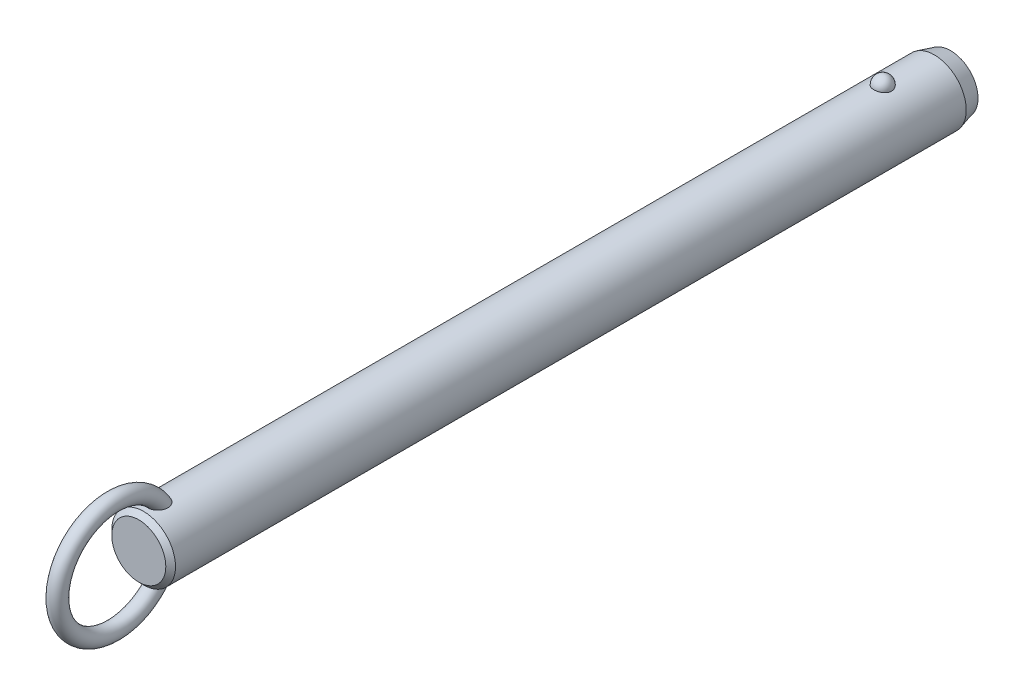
ISO-10303-21;
HEADER;
FILE_DESCRIPTION(('STEP AP214'),'2;1');
FILE_NAME('part.step','',(''),(''),'','','');
FILE_SCHEMA(('AUTOMOTIVE_DESIGN { 1 0 10303 214 1 1 1 1 }'));
ENDSEC;
DATA;
#1=APPLICATION_CONTEXT('core data for automotive mechanical design processes');
#2=APPLICATION_PROTOCOL_DEFINITION('international standard','automotive_design',2000,#1);
#3=PRODUCT_CONTEXT('',#1,'mechanical');
#4=PRODUCT('Part','Part','',(#3));
#5=PRODUCT_RELATED_PRODUCT_CATEGORY('part','',(#4));
#6=PRODUCT_DEFINITION_FORMATION('','',#4);
#7=PRODUCT_DEFINITION_CONTEXT('part definition',#1,'design');
#8=PRODUCT_DEFINITION('design','',#6,#7);
#9=PRODUCT_DEFINITION_SHAPE('','',#8);
#10=(LENGTH_UNIT() NAMED_UNIT(*) SI_UNIT(.MILLI.,.METRE.));
#11=(NAMED_UNIT(*) PLANE_ANGLE_UNIT() SI_UNIT($,.RADIAN.));
#12=(NAMED_UNIT(*) SI_UNIT($,.STERADIAN.) SOLID_ANGLE_UNIT());
#13=UNCERTAINTY_MEASURE_WITH_UNIT(LENGTH_MEASURE(1.E-05),#10,'distance_accuracy_value','');
#14=(GEOMETRIC_REPRESENTATION_CONTEXT(3) GLOBAL_UNCERTAINTY_ASSIGNED_CONTEXT((#13)) GLOBAL_UNIT_ASSIGNED_CONTEXT((#10,
#11,#12)) REPRESENTATION_CONTEXT('',''));
#15=CARTESIAN_POINT('',(0.,0.,0.));
#16=DIRECTION('',(0.,0.,1.));
#17=DIRECTION('',(1.,0.,0.));
#18=AXIS2_PLACEMENT_3D('',#15,#16,#17);
#19=CARTESIAN_POINT('',(0.,0.,172.7));
#20=DIRECTION('',(0.,0.,-1.));
#21=DIRECTION('',(-1.,0.,0.));
#22=AXIS2_PLACEMENT_3D('',#19,#20,#21);
#23=CYLINDRICAL_SURFACE('',#22,7.9);
#24=CARTESIAN_POINT('',(2.1785689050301,7.59367088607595,-2.20000000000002));
#25=CARTESIAN_POINT('',(2.17856679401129,7.59367269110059,-2.07701843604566));
#26=CARTESIAN_POINT('',(2.16853481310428,7.59657145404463,-1.95401006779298));
#27=CARTESIAN_POINT('',(2.12864689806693,7.607843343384,-1.71147811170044));
#28=CARTESIAN_POINT('',(2.09878338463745,7.61621856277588,-1.5919558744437));
#29=CARTESIAN_POINT('',(2.0199931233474,7.63749180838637,-1.35985638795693));
#30=CARTESIAN_POINT('',(1.97107475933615,7.6503878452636,-1.24727610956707));
#31=CARTESIAN_POINT('',(1.85539377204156,7.67926115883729,-1.03213234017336));
#32=CARTESIAN_POINT('',(1.78863158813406,7.69523835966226,-0.929568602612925));
#33=CARTESIAN_POINT('',(1.63856494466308,7.7285848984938,-0.73678633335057));
#34=CARTESIAN_POINT('',(1.55518140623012,7.7459606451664,-0.646630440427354));
#35=CARTESIAN_POINT('',(1.37422937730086,7.78009978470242,-0.481747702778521));
#36=CARTESIAN_POINT('',(1.27666086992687,7.79686317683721,-0.407020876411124));
#37=CARTESIAN_POINT('',(1.07024728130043,7.82786153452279,-0.275278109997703));
#38=CARTESIAN_POINT('',(0.961434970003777,7.84210353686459,-0.218212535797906));
#39=CARTESIAN_POINT('',(0.735351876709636,7.86652194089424,-0.123146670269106));
#40=CARTESIAN_POINT('',(0.618082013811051,7.87669878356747,-0.0851443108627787));
#41=CARTESIAN_POINT('',(0.380637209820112,7.89170521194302,-0.0298158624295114));
#42=CARTESIAN_POINT('',(0.260550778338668,7.89662650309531,-0.0121347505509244));
#43=CARTESIAN_POINT('',(0.0190117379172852,7.90090003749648,0.00324379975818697));
#44=CARTESIAN_POINT('',(-0.102440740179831,7.90025280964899,0.000943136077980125));
#45=CARTESIAN_POINT('',(-0.341452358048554,7.89351056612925,-0.0233955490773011));
#46=CARTESIAN_POINT('',(-0.459042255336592,7.88749257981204,-0.0451545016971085));
#47=CARTESIAN_POINT('',(-0.688796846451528,7.87075812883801,-0.107408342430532));
#48=CARTESIAN_POINT('',(-0.800961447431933,7.86004158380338,-0.14790355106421));
#49=CARTESIAN_POINT('',(-1.01743634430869,7.83497131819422,-0.246799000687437));
#50=CARTESIAN_POINT('',(-1.12169791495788,7.82059709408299,-0.305300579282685));
#51=CARTESIAN_POINT('',(-1.31891765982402,7.78976470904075,-0.43854939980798));
#52=CARTESIAN_POINT('',(-1.41187469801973,7.77330633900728,-0.513298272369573));
#53=CARTESIAN_POINT('',(-1.58577142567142,7.73972434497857,-0.678622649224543));
#54=CARTESIAN_POINT('',(-1.66645140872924,7.72259402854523,-0.769470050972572));
#55=CARTESIAN_POINT('',(-1.81161503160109,7.68983776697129,-0.963538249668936));
#56=CARTESIAN_POINT('',(-1.87609753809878,7.6742119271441,-1.0667599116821));
#57=CARTESIAN_POINT('',(-1.98790138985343,7.6460202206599,-1.28401170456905));
#58=CARTESIAN_POINT('',(-2.03501994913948,7.63349104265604,-1.39815107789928));
#59=CARTESIAN_POINT('',(-2.10986724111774,7.6131449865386,-1.6330178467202));
#60=CARTESIAN_POINT('',(-2.1375965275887,7.60532797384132,-1.75374505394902));
#61=CARTESIAN_POINT('',(-2.17289256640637,7.5953195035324,-1.99782562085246));
#62=CARTESIAN_POINT('',(-2.18054294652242,7.59310471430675,-2.12116592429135));
#63=CARTESIAN_POINT('',(-2.17572919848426,7.59448538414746,-2.36741799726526));
#64=CARTESIAN_POINT('',(-2.1632656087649,7.59808068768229,-2.49032977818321));
#65=CARTESIAN_POINT('',(-2.11865035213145,7.61064035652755,-2.73161015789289));
#66=CARTESIAN_POINT('',(-2.08659579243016,7.61957823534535,-2.84999812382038));
#67=CARTESIAN_POINT('',(-2.00367799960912,7.64179982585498,-3.07955956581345));
#68=CARTESIAN_POINT('',(-1.9528140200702,7.65508371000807,-3.19073275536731));
#69=CARTESIAN_POINT('',(-1.83321113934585,7.68460381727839,-3.40337899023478));
#70=CARTESIAN_POINT('',(-1.76437735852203,7.70085556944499,-3.5047965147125));
#71=CARTESIAN_POINT('',(-1.61069526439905,7.73445734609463,-3.69446912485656));
#72=CARTESIAN_POINT('',(-1.52584634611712,7.75180741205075,-3.78272371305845));
#73=CARTESIAN_POINT('',(-1.34198059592,7.78574608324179,-3.94393987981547));
#74=CARTESIAN_POINT('',(-1.24291308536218,7.80233167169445,-4.01684434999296));
#75=CARTESIAN_POINT('',(-1.03352039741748,7.83281625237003,-4.14489386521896));
#76=CARTESIAN_POINT('',(-0.92319600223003,7.84671543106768,-4.20004014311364));
#77=CARTESIAN_POINT('',(-0.695822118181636,7.87011575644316,-4.29042017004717));
#78=CARTESIAN_POINT('',(-0.578872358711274,7.87966903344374,-4.32589112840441));
#79=CARTESIAN_POINT('',(-0.340410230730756,7.8935652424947,-4.37692226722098));
#80=CARTESIAN_POINT('',(-0.218898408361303,7.89790879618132,-4.39248482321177));
#81=CARTESIAN_POINT('',(0.0228107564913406,7.90087453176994,-4.40314405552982));
#82=CARTESIAN_POINT('',(0.142990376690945,7.89960185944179,-4.39861683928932));
#83=CARTESIAN_POINT('',(0.380829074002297,7.89171262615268,-4.37008293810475));
#84=CARTESIAN_POINT('',(0.498488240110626,7.8850962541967,-4.34607694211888));
#85=CARTESIAN_POINT('',(0.727535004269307,7.86726442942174,-4.27939317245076));
#86=CARTESIAN_POINT('',(0.838944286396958,7.85606616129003,-4.23678512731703));
#87=CARTESIAN_POINT('',(1.05295421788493,7.83025654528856,-4.13408348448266));
#88=CARTESIAN_POINT('',(1.15555431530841,7.81564498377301,-4.07398879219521));
#89=CARTESIAN_POINT('',(1.35076763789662,7.7843022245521,-3.93687432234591));
#90=CARTESIAN_POINT('',(1.4432046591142,7.76754209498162,-3.85961036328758));
#91=CARTESIAN_POINT('',(1.6139111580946,7.73387857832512,-3.69076949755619));
#92=CARTESIAN_POINT('',(1.6921781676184,7.71697516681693,-3.59919010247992));
#93=CARTESIAN_POINT('',(1.83380875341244,7.6845643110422,-3.40247278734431));
#94=CARTESIAN_POINT('',(1.89689280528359,7.66908588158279,-3.29712873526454));
#95=CARTESIAN_POINT('',(2.0047823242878,7.64159441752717,-3.07707931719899));
#96=CARTESIAN_POINT('',(2.0495945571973,7.62958010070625,-2.96237743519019));
#97=CARTESIAN_POINT('',(2.11580183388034,7.61146617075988,-2.74040519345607));
#98=CARTESIAN_POINT('',(2.13929812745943,7.60484503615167,-2.63379846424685));
#99=CARTESIAN_POINT('',(2.17068242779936,7.59594664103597,-2.4181348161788));
#100=CARTESIAN_POINT('',(2.17857077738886,7.59366928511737,-2.30907795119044));
#101=CARTESIAN_POINT('',(2.1785689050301,7.59367088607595,-2.20000000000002));
#102=B_SPLINE_CURVE_WITH_KNOTS('',3,(#24,#25,#26,#27,#28,#29,#30,#31,#32,#33,#34,#35,#36,#37,
#38,#39,#40,#41,#42,#43,#44,#45,#46,#47,#48,#49,#50,#51,#52,#53,#54,#55,#56,#57,#58,#59,#60,#61,
#62,#63,#64,#65,#66,#67,#68,#69,#70,#71,#72,#73,#74,#75,#76,#77,#78,#79,#80,#81,#82,#83,#84,#85,
#86,#87,#88,#89,#90,#91,#92,#93,#94,#95,#96,#97,#98,#99,#100,#101),.UNSPECIFIED.,.T.,.F.,(4,2,2,
2,2,2,2,2,2,2,2,2,2,2,2,2,2,2,2,2,2,2,2,2,2,2,2,2,2,2,2,2,2,2,2,2,2,2,4),(0.,0.368552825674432,
0.737246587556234,1.10577831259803,1.4743009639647,1.8446206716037,2.21494081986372,
2.5842105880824,2.95344028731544,3.31611630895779,3.67875788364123,4.03628044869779,
4.39380913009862,4.75338791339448,5.11300280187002,5.47939989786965,5.8458226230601,
6.21639834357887,6.58696347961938,6.95598276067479,7.32499216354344,7.69218715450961,
8.0593967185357,8.42858578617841,8.79778880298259,9.16834203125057,9.5388695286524,
9.90482699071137,10.2707407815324,10.6298333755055,10.9889132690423,11.3466585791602,
11.7044262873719,12.0676511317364,12.4309391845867,12.8004764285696,13.1698767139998,
13.4967701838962,13.8236564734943),.UNSPECIFIED.);
#103=CARTESIAN_POINT('',(2.1785689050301,7.59367088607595,-2.20000000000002));
#104=VERTEX_POINT('',#103);
#105=EDGE_CURVE('E41',#104,#104,#102,.T.);
#106=ORIENTED_EDGE('',*,*,#105,.T.);
#107=EDGE_LOOP('',(#106));
#108=FACE_BOUND('',#107,.T.);
#109=CARTESIAN_POINT('',(0.,0.,181.02));
#110=DIRECTION('',(0.,0.,1.));
#111=DIRECTION('',(1.,0.,0.));
#112=AXIS2_PLACEMENT_3D('',#109,#110,#111);
#113=CIRCLE('',#112,7.9);
#114=CARTESIAN_POINT('',(7.9,0.,181.02));
#115=VERTEX_POINT('',#114);
#116=EDGE_CURVE('E10',#115,#115,#113,.F.);
#117=ORIENTED_EDGE('',*,*,#116,.T.);
#118=EDGE_LOOP('',(#117));
#119=FACE_BOUND('',#118,.T.);
#120=CARTESIAN_POINT('',(-0.630969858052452,-7.87476203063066,174.912432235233));
#121=CARTESIAN_POINT('',(-0.734180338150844,-7.86648998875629,174.947285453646));
#122=CARTESIAN_POINT('',(-0.834476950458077,-7.85639291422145,174.990816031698));
#123=CARTESIAN_POINT('',(-1.0262035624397,-7.83366343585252,175.094094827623));
#124=CARTESIAN_POINT('',(-1.1176141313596,-7.82102565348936,175.153877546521));
#125=CARTESIAN_POINT('',(-1.28877277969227,-7.79464922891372,175.287839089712));
#126=CARTESIAN_POINT('',(-1.36854014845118,-7.78091246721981,175.361993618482));
#127=CARTESIAN_POINT('',(-1.51461521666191,-7.75380398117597,175.522494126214));
#128=CARTESIAN_POINT('',(-1.58092966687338,-7.74043207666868,175.608833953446));
#129=CARTESIAN_POINT('',(-1.70019064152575,-7.7151252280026,175.792978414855));
#130=CARTESIAN_POINT('',(-1.75284037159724,-7.70322473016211,175.890979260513));
#131=CARTESIAN_POINT('',(-1.84263464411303,-7.68224112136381,176.094102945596));
#132=CARTESIAN_POINT('',(-1.87977299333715,-7.6731591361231,176.199228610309));
#133=CARTESIAN_POINT('',(-1.94152728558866,-7.65777930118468,176.423284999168));
#134=CARTESIAN_POINT('',(-1.96475471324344,-7.65179654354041,176.542616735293));
#135=CARTESIAN_POINT('',(-1.99449499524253,-7.64409642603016,176.78342986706));
#136=CARTESIAN_POINT('',(-2.0010005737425,-7.64238092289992,176.904912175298));
#137=CARTESIAN_POINT('',(-1.99856014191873,-7.64302120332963,177.168340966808));
#138=CARTESIAN_POINT('',(-1.98680021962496,-7.64611845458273,177.31025654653));
#139=CARTESIAN_POINT('',(-1.94457772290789,-7.65696186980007,177.591118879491));
#140=CARTESIAN_POINT('',(-1.91409393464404,-7.66471330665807,177.730062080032));
#141=CARTESIAN_POINT('',(-1.82768670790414,-7.68582947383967,178.031939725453));
#142=CARTESIAN_POINT('',(-1.76772963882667,-7.70003779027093,178.193686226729));
#143=CARTESIAN_POINT('',(-1.65998501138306,-7.72371550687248,178.427695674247));
#144=CARTESIAN_POINT('',(-1.62107967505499,-7.73200670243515,178.504297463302));
#145=CARTESIAN_POINT('',(-1.53727726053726,-7.74910377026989,178.654079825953));
#146=CARTESIAN_POINT('',(-1.4923821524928,-7.75790947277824,178.727261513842));
#147=CARTESIAN_POINT('',(-1.37397050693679,-7.77993338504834,178.90288382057));
#148=CARTESIAN_POINT('',(-1.29690364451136,-7.79328473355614,179.002955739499));
#149=CARTESIAN_POINT('',(-1.1288548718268,-7.81939266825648,179.190714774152));
#150=CARTESIAN_POINT('',(-1.03789926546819,-7.83215032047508,179.278424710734));
#151=CARTESIAN_POINT('',(-0.869532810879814,-7.85231710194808,179.413414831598));
#152=CARTESIAN_POINT('',(-0.795716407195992,-7.86021093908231,179.465076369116));
#153=CARTESIAN_POINT('',(-0.640813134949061,-7.87434920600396,179.556381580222));
#154=CARTESIAN_POINT('',(-0.559737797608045,-7.88059619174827,179.59604389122));
#155=CARTESIAN_POINT('',(-0.406456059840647,-7.88984116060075,179.654300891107));
#156=CARTESIAN_POINT('',(-0.335227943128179,-7.89321892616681,179.675384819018));
#157=CARTESIAN_POINT('',(-0.190193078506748,-7.89804235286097,179.70541418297));
#158=CARTESIAN_POINT('',(-0.11638863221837,-7.89948969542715,179.714370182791));
#159=CARTESIAN_POINT('',(0.0318414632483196,-7.90028409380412,179.719291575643));
#160=CARTESIAN_POINT('',(0.106268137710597,-7.89962640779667,179.715227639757));
#161=CARTESIAN_POINT('',(0.253290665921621,-7.8962818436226,179.694461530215));
#162=CARTESIAN_POINT('',(0.325885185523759,-7.8935935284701,179.677750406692));
#163=CARTESIAN_POINT('',(0.481441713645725,-7.88577340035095,179.628738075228));
#164=CARTESIAN_POINT('',(0.563611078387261,-7.88026321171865,179.594005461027));
#165=CARTESIAN_POINT('',(0.721129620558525,-7.86741729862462,179.511796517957));
#166=CARTESIAN_POINT('',(0.796466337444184,-7.86007832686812,179.464297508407));
#167=CARTESIAN_POINT('',(0.971456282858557,-7.84073285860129,179.336513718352));
#168=CARTESIAN_POINT('',(1.06719686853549,-7.82809461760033,179.251004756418));
#169=CARTESIAN_POINT('',(1.24418921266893,-7.80192439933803,179.066232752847));
#170=CARTESIAN_POINT('',(1.32540832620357,-7.78839049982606,178.966939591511));
#171=CARTESIAN_POINT('',(1.45199971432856,-7.76559693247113,178.789576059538));
#172=CARTESIAN_POINT('',(1.50085649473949,-7.75626094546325,178.713954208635));
#173=CARTESIAN_POINT('',(1.59197749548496,-7.7380727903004,178.558742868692));
#174=CARTESIAN_POINT('',(1.63423919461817,-7.72922080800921,178.479151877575));
#175=CARTESIAN_POINT('',(1.71222612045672,-7.71231959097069,178.316664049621));
#176=CARTESIAN_POINT('',(1.74794516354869,-7.70427111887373,178.233764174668));
#177=CARTESIAN_POINT('',(1.81270113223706,-7.68929240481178,178.065296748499));
#178=CARTESIAN_POINT('',(1.84173789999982,-7.68236218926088,177.979729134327));
#179=CARTESIAN_POINT('',(1.89322698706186,-7.6698375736,177.80528702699));
#180=CARTESIAN_POINT('',(1.91558744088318,-7.66426199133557,177.716383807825));
#181=CARTESIAN_POINT('',(1.95281367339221,-7.65485915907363,177.536969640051));
#182=CARTESIAN_POINT('',(1.96767946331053,-7.65103190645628,177.446458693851));
#183=CARTESIAN_POINT('',(2.00021456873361,-7.64262981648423,177.173732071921));
#184=CARTESIAN_POINT('',(2.00600691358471,-7.6410871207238,176.989709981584));
#185=CARTESIAN_POINT('',(1.98445334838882,-7.64669564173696,176.676501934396));
#186=CARTESIAN_POINT('',(1.96607186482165,-7.65149688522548,176.546618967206));
#187=CARTESIAN_POINT('',(1.90884967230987,-7.6659762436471,176.291632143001));
#188=CARTESIAN_POINT('',(1.87002101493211,-7.67565148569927,176.166525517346));
#189=CARTESIAN_POINT('',(1.77063986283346,-7.69918471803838,175.92454013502));
#190=CARTESIAN_POINT('',(1.70993724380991,-7.71307150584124,175.807725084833));
#191=CARTESIAN_POINT('',(1.56733070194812,-7.74330306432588,175.588144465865));
#192=CARTESIAN_POINT('',(1.48543692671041,-7.75964665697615,175.485372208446));
#193=CARTESIAN_POINT('',(1.31346177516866,-7.79047523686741,175.309380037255));
#194=CARTESIAN_POINT('',(1.22547278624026,-7.80495298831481,175.234106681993));
#195=CARTESIAN_POINT('',(1.0372435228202,-7.83218597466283,175.100486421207));
#196=CARTESIAN_POINT('',(0.937008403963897,-7.84494192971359,175.042132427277));
#197=CARTESIAN_POINT('',(0.73359933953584,-7.86649045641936,174.947027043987));
#198=CARTESIAN_POINT('',(0.630941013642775,-7.87547134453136,174.909210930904));
#199=CARTESIAN_POINT('',(0.420465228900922,-7.88950708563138,174.851116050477));
#200=CARTESIAN_POINT('',(0.312645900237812,-7.89456050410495,174.83084369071));
#201=CARTESIAN_POINT('',(0.0960869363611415,-7.9001518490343,174.808455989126));
#202=CARTESIAN_POINT('',(-0.012634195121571,-7.90073226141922,174.806169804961));
#203=CARTESIAN_POINT('',(-0.228766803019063,-7.89742350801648,174.819367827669));
#204=CARTESIAN_POINT('',(-0.336180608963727,-7.89354403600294,174.834813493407));
#205=CARTESIAN_POINT('',(-0.473410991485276,-7.88586871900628,174.866217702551));
#206=CARTESIAN_POINT('',(-0.505257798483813,-7.88388984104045,174.874354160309));
#207=CARTESIAN_POINT('',(-0.568481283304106,-7.87958326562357,174.892208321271));
#208=CARTESIAN_POINT('',(-0.599857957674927,-7.87725556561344,174.901926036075));
#209=CARTESIAN_POINT('',(-0.630969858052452,-7.87476203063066,174.912432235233));
#210=B_SPLINE_CURVE_WITH_KNOTS('',3,(#120,#121,#122,#123,#124,#125,#126,#127,#128,#129,#130,
#131,#132,#133,#134,#135,#136,#137,#138,#139,#140,#141,#142,#143,#144,#145,#146,#147,#148,#149,
#150,#151,#152,#153,#154,#155,#156,#157,#158,#159,#160,#161,#162,#163,#164,#165,#166,#167,#168,
#169,#170,#171,#172,#173,#174,#175,#176,#177,#178,#179,#180,#181,#182,#183,#184,#185,#186,#187,
#188,#189,#190,#191,#192,#193,#194,#195,#196,#197,#198,#199,#200,#201,#202,#203,#204,#205,#206,
#207,#208,#209),.UNSPECIFIED.,.T.,.F.,(4,2,2,2,2,2,2,2,2,2,2,2,2,2,2,2,2,2,2,2,2,2,2,2,2,2,2,2,
2,2,2,2,2,2,2,2,2,2,2,2,2,2,2,2,4),(0.,0.327622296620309,0.655945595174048,0.983718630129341,
1.3113267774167,1.64554655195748,1.97989964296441,2.34365728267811,2.70757317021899,
3.13333684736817,3.55958380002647,4.07655306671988,4.33527897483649,4.59391999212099,
4.97382437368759,5.353017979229,5.62348245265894,5.89352465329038,6.11565959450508,
6.33760092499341,6.56004255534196,6.78264174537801,7.0493084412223,7.31645206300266,
7.70130871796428,8.08701995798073,8.35824509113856,8.62957365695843,8.9011573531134,
9.1727474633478,9.44791855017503,9.72308922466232,10.2715298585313,10.6638393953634,
11.0559179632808,11.4507403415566,11.8453740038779,12.1936425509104,12.5417649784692,
12.8695063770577,13.1973674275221,13.5221104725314,13.8461490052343,13.9449071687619,
14.0436660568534),.UNSPECIFIED.);
#211=CARTESIAN_POINT('',(-0.630969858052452,-7.87476203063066,174.912432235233));
#212=VERTEX_POINT('',#211);
#213=EDGE_CURVE('E59',#212,#212,#210,.T.);
#214=ORIENTED_EDGE('',*,*,#213,.T.);
#215=EDGE_LOOP('',(#214));
#216=FACE_BOUND('',#215,.T.);
#217=CARTESIAN_POINT('',(-0.630969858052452,7.87476203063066,174.912432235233));
#218=CARTESIAN_POINT('',(-0.528918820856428,7.88293636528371,174.877979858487));
#219=CARTESIAN_POINT('',(-0.423745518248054,7.88934810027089,174.851915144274));
#220=CARTESIAN_POINT('',(-0.210236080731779,7.8979273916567,174.817282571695));
#221=CARTESIAN_POINT('',(-0.101893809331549,7.90008607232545,174.808751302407));
#222=CARTESIAN_POINT('',(0.11466056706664,7.89990877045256,174.809457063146));
#223=CARTESIAN_POINT('',(0.222872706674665,7.89757640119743,174.81867980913));
#224=CARTESIAN_POINT('',(0.436107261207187,7.88867538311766,174.854652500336));
#225=CARTESIAN_POINT('',(0.541131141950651,7.8821087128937,174.88139425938));
#226=CARTESIAN_POINT('',(0.745085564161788,7.86545130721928,174.951756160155));
#227=CARTESIAN_POINT('',(0.844015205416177,7.85536005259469,174.995378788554));
#228=CARTESIAN_POINT('',(1.03299167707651,7.83275153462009,175.098379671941));
#229=CARTESIAN_POINT('',(1.12303841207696,7.8202342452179,175.157758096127));
#230=CARTESIAN_POINT('',(1.29214734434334,7.79408219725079,175.290864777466));
#231=CARTESIAN_POINT('',(1.37116907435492,7.78044359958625,175.364643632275));
#232=CARTESIAN_POINT('',(1.51597677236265,7.75353170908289,175.524235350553));
#233=CARTESIAN_POINT('',(1.58176261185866,7.74025841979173,175.610048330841));
#234=CARTESIAN_POINT('',(1.70057386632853,7.71504069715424,175.793644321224));
#235=CARTESIAN_POINT('',(1.75320073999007,7.7031425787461,175.891690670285));
#236=CARTESIAN_POINT('',(1.8429376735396,7.68216822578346,176.094893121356));
#237=CARTESIAN_POINT('',(1.88004278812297,7.67309289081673,176.200051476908));
#238=CARTESIAN_POINT('',(1.9417232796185,7.6577294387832,176.424167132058));
#239=CARTESIAN_POINT('',(1.96491037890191,7.65175648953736,176.543524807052));
#240=CARTESIAN_POINT('',(1.9945689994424,7.64407702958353,176.784384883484));
#241=CARTESIAN_POINT('',(2.00103304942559,7.64237242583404,176.90588821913));
#242=CARTESIAN_POINT('',(1.99850166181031,7.64303650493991,177.169368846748));
#243=CARTESIAN_POINT('',(1.98669038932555,7.64614714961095,177.311314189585));
#244=CARTESIAN_POINT('',(1.94436120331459,7.6570170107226,177.592228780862));
#245=CARTESIAN_POINT('',(1.91382203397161,7.66478150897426,177.731194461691));
#246=CARTESIAN_POINT('',(1.82728754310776,7.68592483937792,178.033111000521));
#247=CARTESIAN_POINT('',(1.76725778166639,7.7001468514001,178.194872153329));
#248=CARTESIAN_POINT('',(1.65939700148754,7.72384204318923,178.428891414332));
#249=CARTESIAN_POINT('',(1.62045187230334,7.73213852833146,178.505494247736));
#250=CARTESIAN_POINT('',(1.53656684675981,7.74924489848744,178.655273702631));
#251=CARTESIAN_POINT('',(1.49162892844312,7.75805461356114,178.728451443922));
#252=CARTESIAN_POINT('',(1.37317698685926,7.78007342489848,178.903952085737));
#253=CARTESIAN_POINT('',(1.29612360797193,7.79341423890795,179.003911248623));
#254=CARTESIAN_POINT('',(1.12812043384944,7.81949839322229,179.19145083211));
#255=CARTESIAN_POINT('',(1.03719688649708,7.83224280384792,179.279054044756));
#256=CARTESIAN_POINT('',(0.868871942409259,7.85239026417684,179.41389715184));
#257=CARTESIAN_POINT('',(0.795056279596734,7.86027769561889,179.465511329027));
#258=CARTESIAN_POINT('',(0.640160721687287,7.87440222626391,179.556720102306));
#259=CARTESIAN_POINT('',(0.559092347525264,7.88064188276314,179.596333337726));
#260=CARTESIAN_POINT('',(0.405820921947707,7.8898738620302,179.654505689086));
#261=CARTESIAN_POINT('',(0.334594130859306,7.89324577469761,179.675552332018));
#262=CARTESIAN_POINT('',(0.189568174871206,7.89805733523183,179.705507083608));
#263=CARTESIAN_POINT('',(0.115771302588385,7.89949866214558,179.714425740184));
#264=CARTESIAN_POINT('',(-0.0324359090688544,7.90028156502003,179.71927589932));
#265=CARTESIAN_POINT('',(-0.106847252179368,7.89961843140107,179.715178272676));
#266=CARTESIAN_POINT('',(-0.253834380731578,7.8962642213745,179.694351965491));
#267=CARTESIAN_POINT('',(-0.326408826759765,7.89357170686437,179.677614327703));
#268=CARTESIAN_POINT('',(-0.481962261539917,7.88574179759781,179.628539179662));
#269=CARTESIAN_POINT('',(-0.564145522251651,7.88022507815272,179.593763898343));
#270=CARTESIAN_POINT('',(-0.7216852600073,7.86736646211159,179.511468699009));
#271=CARTESIAN_POINT('',(-0.797029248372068,7.8600213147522,179.463926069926));
#272=CARTESIAN_POINT('',(-0.972044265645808,7.84066026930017,179.336026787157));
#273=CARTESIAN_POINT('',(-1.06779803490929,7.828012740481,179.250443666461));
#274=CARTESIAN_POINT('',(-1.24480531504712,7.80182621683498,179.065522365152));
#275=CARTESIAN_POINT('',(-1.32602618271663,7.78828530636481,178.966154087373));
#276=CARTESIAN_POINT('',(-1.4525983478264,7.76548487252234,178.788680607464));
#277=CARTESIAN_POINT('',(-1.50143856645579,7.75614818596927,178.713025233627));
#278=CARTESIAN_POINT('',(-1.59252410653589,7.73796020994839,178.557748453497));
#279=CARTESIAN_POINT('',(-1.63476690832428,7.729109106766,178.478125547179));
#280=CARTESIAN_POINT('',(-1.7127131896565,7.71221133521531,178.315575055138));
#281=CARTESIAN_POINT('',(-1.74841047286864,7.70416543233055,178.232644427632));
#282=CARTESIAN_POINT('',(-1.81311929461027,7.6891937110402,178.064116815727));
#283=CARTESIAN_POINT('',(-1.84213067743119,7.68226791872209,177.978519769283));
#284=CARTESIAN_POINT('',(-1.89356259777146,7.66975461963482,177.804025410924));
#285=CARTESIAN_POINT('',(-1.91589165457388,7.66418586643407,177.715099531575));
#286=CARTESIAN_POINT('',(-1.9530507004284,7.65479859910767,177.535642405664));
#287=CARTESIAN_POINT('',(-1.96788069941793,7.65098008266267,177.445111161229));
#288=CARTESIAN_POINT('',(-2.00030078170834,7.64260704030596,177.172327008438));
#289=CARTESIAN_POINT('',(-2.00600576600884,7.64108760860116,176.988271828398));
#290=CARTESIAN_POINT('',(-1.9842848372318,7.64673945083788,176.675080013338));
#291=CARTESIAN_POINT('',(-1.96583698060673,7.65155751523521,176.545240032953));
#292=CARTESIAN_POINT('',(-1.90848948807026,7.66606613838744,176.290361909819));
#293=CARTESIAN_POINT('',(-1.86960376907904,7.67575338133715,176.165320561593));
#294=CARTESIAN_POINT('',(-1.77013421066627,7.6993013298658,175.923500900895));
#295=CARTESIAN_POINT('',(-1.70940488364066,7.71318991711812,175.806784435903));
#296=CARTESIAN_POINT('',(-1.5667295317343,7.74342495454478,175.587340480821));
#297=CARTESIAN_POINT('',(-1.48478316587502,7.75977144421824,175.48461321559));
#298=CARTESIAN_POINT('',(-1.31266325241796,7.79061163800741,175.308643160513));
#299=CARTESIAN_POINT('',(-1.22456383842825,7.80509908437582,175.233358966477));
#300=CARTESIAN_POINT('',(-1.03622400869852,7.83231881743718,175.099865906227));
#301=CARTESIAN_POINT('',(-0.93601531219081,7.84505551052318,175.041613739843));
#302=CARTESIAN_POINT('',(-0.798824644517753,7.85957802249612,174.977540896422));
#303=CARTESIAN_POINT('',(-0.765787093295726,7.86286821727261,174.963224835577));
#304=CARTESIAN_POINT('',(-0.698939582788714,7.86909211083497,174.936436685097));
#305=CARTESIAN_POINT('',(-0.665129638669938,7.8720258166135,174.923964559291));
#306=CARTESIAN_POINT('',(-0.630969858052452,7.87476203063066,174.912432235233));
#307=B_SPLINE_CURVE_WITH_KNOTS('',3,(#217,#218,#219,#220,#221,#222,#223,#224,#225,#226,#227,
#228,#229,#230,#231,#232,#233,#234,#235,#236,#237,#238,#239,#240,#241,#242,#243,#244,#245,#246,
#247,#248,#249,#250,#251,#252,#253,#254,#255,#256,#257,#258,#259,#260,#261,#262,#263,#264,#265,
#266,#267,#268,#269,#270,#271,#272,#273,#274,#275,#276,#277,#278,#279,#280,#281,#282,#283,#284,
#285,#286,#287,#288,#289,#290,#291,#292,#293,#294,#295,#296,#297,#298,#299,#300,#301,#302,#303,
#304,#305,#306),.UNSPECIFIED.,.T.,.F.,(4,2,2,2,2,2,2,2,2,2,2,2,2,2,2,2,2,2,2,2,2,2,2,2,2,2,2,2,
2,2,2,2,2,2,2,2,2,2,2,2,2,2,2,2,4),(0.,0.323920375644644,0.648516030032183,0.972850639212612,
1.29703380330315,1.62126473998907,1.94549915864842,2.27089401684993,2.5962920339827,
2.93059633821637,3.26500707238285,3.6288164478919,3.99278833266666,4.4186542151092,
4.84500434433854,5.36209210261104,5.62087589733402,5.87957448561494,6.25918598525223,
6.63808782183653,6.90846748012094,7.17842501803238,7.40052350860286,7.6224287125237,
7.84483086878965,8.0673907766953,8.33414615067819,8.60137921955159,8.98641454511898,
9.37230415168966,9.64358673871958,9.91497268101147,10.1866142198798,10.4582620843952,
10.7334745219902,11.008686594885,11.5572126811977,11.9494246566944,12.3413699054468,
12.7359755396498,13.1305875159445,13.4791770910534,13.82687259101,13.9353013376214,
14.0437279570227),.UNSPECIFIED.);
#308=CARTESIAN_POINT('',(-0.630969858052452,7.87476203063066,174.912432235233));
#309=VERTEX_POINT('',#308);
#310=EDGE_CURVE('E67',#309,#309,#307,.T.);
#311=ORIENTED_EDGE('',*,*,#310,.T.);
#312=EDGE_LOOP('',(#311));
#313=FACE_BOUND('',#312,.T.);
#314=CARTESIAN_POINT('',(0.,0.,-15.));
#315=DIRECTION('',(0.,0.,-1.));
#316=DIRECTION('',(-1.,0.,0.));
#317=AXIS2_PLACEMENT_3D('',#314,#315,#316);
#318=CIRCLE('',#317,7.9);
#319=CARTESIAN_POINT('',(-7.9,0.,-15.));
#320=VERTEX_POINT('',#319);
#321=EDGE_CURVE('E56',#320,#320,#318,.F.);
#322=ORIENTED_EDGE('',*,*,#321,.T.);
#323=EDGE_LOOP('',(#322));
#324=FACE_BOUND('',#323,.T.);
#325=ADVANCED_FACE('F37',(#108,#119,#216,#313,#324),#23,.T.);
#326=CARTESIAN_POINT('',(0.,0.,-19.));
#327=DIRECTION('',(0.,0.,-1.));
#328=DIRECTION('',(-1.,0.,0.));
#329=AXIS2_PLACEMENT_3D('',#326,#327,#328);
#330=PLANE('',#329);
#331=CARTESIAN_POINT('',(0.,0.,-19.));
#332=DIRECTION('',(0.,0.,-1.));
#333=DIRECTION('',(-1.,0.,0.));
#334=AXIS2_PLACEMENT_3D('',#331,#332,#333);
#335=CIRCLE('',#334,6.82820323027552);
#336=CARTESIAN_POINT('',(-6.82820323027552,0.,-19.));
#337=VERTEX_POINT('',#336);
#338=EDGE_CURVE('E66',#337,#337,#335,.T.);
#339=ORIENTED_EDGE('',*,*,#338,.T.);
#340=EDGE_LOOP('',(#339));
#341=FACE_BOUND('',#340,.T.);
#342=ADVANCED_FACE('F85',(#341),#330,.T.);
#343=CARTESIAN_POINT('',(0.,0.,-19.));
#344=DIRECTION('',(0.,0.,1.));
#345=DIRECTION('',(1.,0.,0.));
#346=AXIS2_PLACEMENT_3D('',#343,#344,#345);
#347=CONICAL_SURFACE('',#346,6.82820323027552,0.261799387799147);
#348=ORIENTED_EDGE('',*,*,#321,.F.);
#349=EDGE_LOOP('',(#348));
#350=FACE_BOUND('',#349,.T.);
#351=ORIENTED_EDGE('',*,*,#338,.F.);
#352=EDGE_LOOP('',(#351));
#353=FACE_BOUND('',#352,.T.);
#354=ADVANCED_FACE('F83',(#350,#353),#347,.T.);
#355=CARTESIAN_POINT('',(0.,0.,182.22));
#356=DIRECTION('',(0.,0.,1.));
#357=DIRECTION('',(1.,0.,0.));
#358=AXIS2_PLACEMENT_3D('',#355,#356,#357);
#359=PLANE('',#358);
#360=CARTESIAN_POINT('',(0.,0.,182.22));
#361=DIRECTION('',(0.,0.,1.));
#362=DIRECTION('',(1.,0.,0.));
#363=AXIS2_PLACEMENT_3D('',#360,#361,#362);
#364=CIRCLE('',#363,6.69999999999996);
#365=CARTESIAN_POINT('',(6.69999999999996,0.,182.22));
#366=VERTEX_POINT('',#365);
#367=EDGE_CURVE('E50',#366,#366,#364,.T.);
#368=ORIENTED_EDGE('',*,*,#367,.T.);
#369=EDGE_LOOP('',(#368));
#370=FACE_BOUND('',#369,.T.);
#371=ADVANCED_FACE('F77',(#370),#359,.T.);
#372=CARTESIAN_POINT('',(0.,0.,188.55));
#373=DIRECTION('',(1.,0.,0.));
#374=DIRECTION('',(0.,0.,-1.));
#375=AXIS2_PLACEMENT_3D('',#372,#373,#374);
#376=TOROIDAL_SURFACE('',#375,13.85,2.);
#377=ORIENTED_EDGE('',*,*,#310,.F.);
#378=EDGE_LOOP('',(#377));
#379=FACE_BOUND('',#378,.T.);
#380=ORIENTED_EDGE('',*,*,#213,.F.);
#381=EDGE_LOOP('',(#380));
#382=FACE_BOUND('',#381,.T.);
#383=ADVANCED_FACE('F73',(#379,#382),#376,.T.);
#384=CARTESIAN_POINT('',(0.,0.,182.22));
#385=DIRECTION('',(0.,0.,-1.));
#386=DIRECTION('',(-1.,0.,0.));
#387=AXIS2_PLACEMENT_3D('',#384,#385,#386);
#388=CONICAL_SURFACE('',#387,6.69999999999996,0.785398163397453);
#389=ORIENTED_EDGE('',*,*,#116,.F.);
#390=EDGE_LOOP('',(#389));
#391=FACE_BOUND('',#390,.T.);
#392=ORIENTED_EDGE('',*,*,#367,.F.);
#393=EDGE_LOOP('',(#392));
#394=FACE_BOUND('',#393,.T.);
#395=ADVANCED_FACE('F39',(#391,#394),#388,.T.);
#396=CARTESIAN_POINT('',(0.,7.9,-2.20000000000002));
#397=DIRECTION('',(0.,1.,0.));
#398=DIRECTION('',(0.,0.,-1.));
#399=AXIS2_PLACEMENT_3D('',#396,#397,#398);
#400=SPHERICAL_SURFACE('',#399,2.2);
#401=ORIENTED_EDGE('',*,*,#105,.F.);
#402=EDGE_LOOP('',(#401));
#403=FACE_BOUND('',#402,.T.);
#404=ADVANCED_FACE('F79',(#403),#400,.T.);
#405=CLOSED_SHELL('',(#325,#342,#354,#371,#383,#395,#404));
#406=MANIFOLD_SOLID_BREP('B2',#405);
#407=ADVANCED_BREP_SHAPE_REPRESENTATION('',(#18,#406),#14);
#408=SHAPE_DEFINITION_REPRESENTATION(#9,#407);
ENDSEC;
END-ISO-10303-21;
